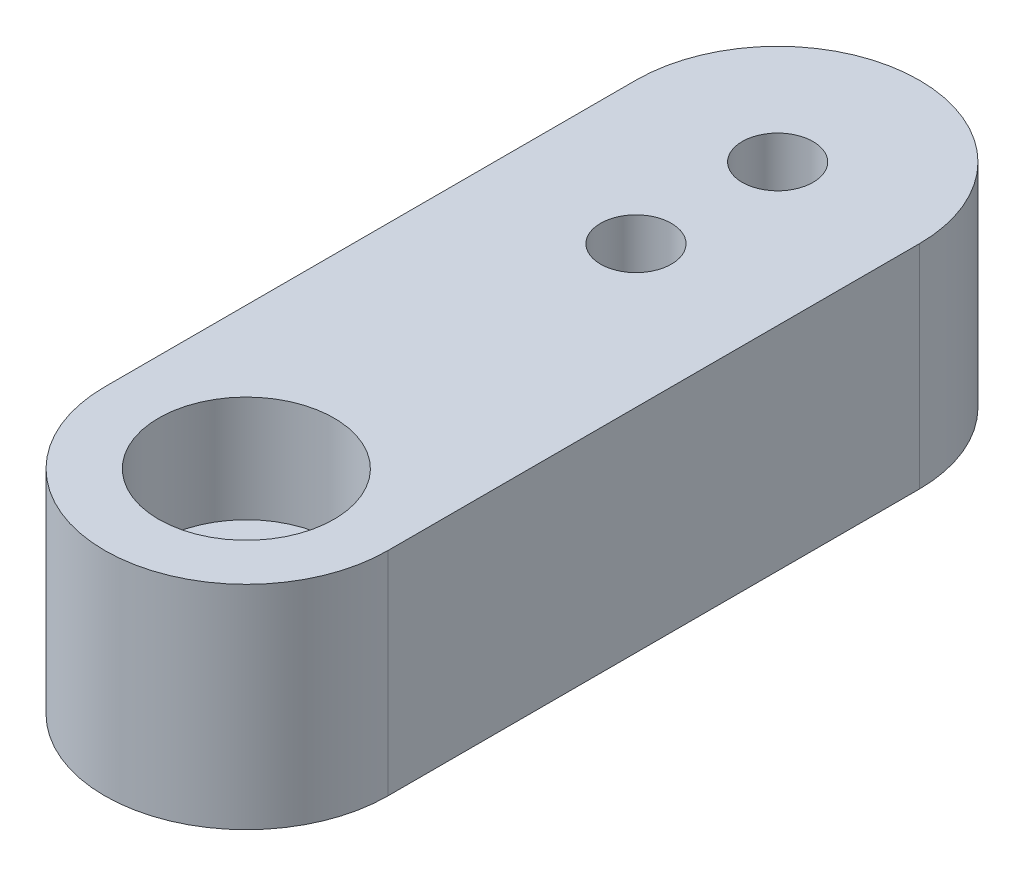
from build123d import *

# Parameters (mm, degrees)
SKETCH1_R           = 1
BOSS_EXTRUDE2_DEPTH = 6
SKETCH2_R           = 2.477027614
CUT_EXTRUDE1_DEPTH  = 3


with BuildPart() as part:
    # Sketch1 → Boss-Extrude2 (new body)
    with BuildSketch(Plane(origin=(0, 0, 0), x_dir=(1, 0, 0), z_dir=(0, 1, 0))):
        with BuildLine():
            Line((0, 0), (0, -15))
            ThreePointArc((0, -15), (4, -19), (8, -15))
            Line((8, -15), (8, 0))
            ThreePointArc((8, 0), (4, 4), (0, 0))
        make_face()
        with Locations(Location((4, 0, 0), (0, 0, 270))):
            Circle(SKETCH1_R, mode=Mode.SUBTRACT)
        with Locations(Location((4, -4, 0), (0, 0, 270))):
            Circle(SKETCH1_R, mode=Mode.SUBTRACT)
        with Locations(Location((4, -15, 0), (0, 0, 270))):
            Circle(SKETCH1_R, mode=Mode.SUBTRACT)
    extrude(amount=BOSS_EXTRUDE2_DEPTH)

    # Sketch2 → Cut-Extrude1 (cut)
    with BuildSketch(Plane(origin=(0, 6, 0), x_dir=(1, 0, 0), z_dir=(0, 1, 0))):
        with Locations(Location((4, -15, 0), (0, 0, 270))):
            Circle(SKETCH2_R)
    extrude(amount=-CUT_EXTRUDE1_DEPTH, mode=Mode.SUBTRACT)


solid = part.part
